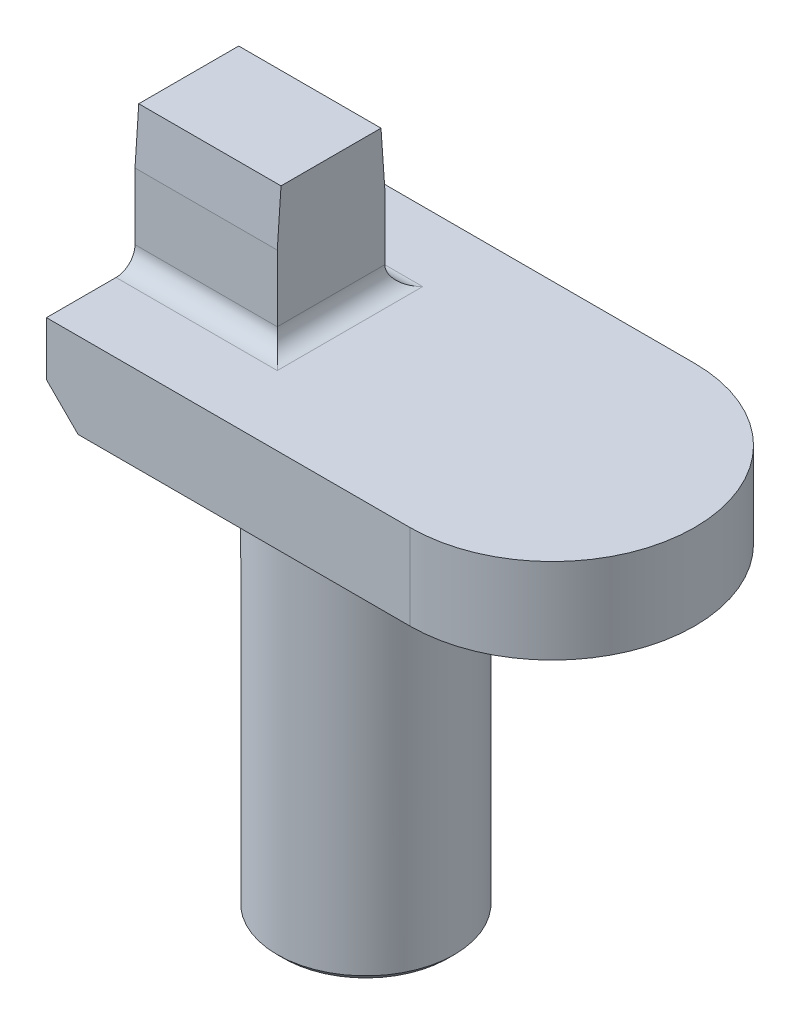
from build123d import *

# Parameters (mm, degrees)
BOSS_EXTRUDE1_DEPTH = 3.429
SKETCH2_R           = 3.556
BOSS_EXTRUDE2_DEPTH = 16.51
CHAMFER2_SIZE       = 0.254
BOSS_EXTRUDE3_START = -3.429
SKETCH3_W           = 5.715
SKETCH3_H           = 4.318
BOSS_EXTRUDE3_DEPTH = 9.017
CHAMFER1_SIZE       = 1.27
FILLET1_R           = 0.762
FILLET2_R           = 0.762
CUT_EXTRUDE1_DEPTH  = 5.715


with BuildPart() as part:
    # Sketch1 → Boss-Extrude1 (new body)
    with BuildSketch(Plane(origin=(0, 0, 0), x_dir=(1, 0, 0), z_dir=(0, 1, 0))):
        with BuildLine():
            Line((7.493, 5.715), (-7.112, 5.715))
            Line((-7.112, 5.715), (-7.112, -5.715))
            Line((-7.112, -5.715), (7.493, -5.715))
            ThreePointArc((7.493, -5.715), (13.208, 0), (7.493, 5.715))
        make_face()
    extrude(amount=BOSS_EXTRUDE1_DEPTH)

    # Sketch2 → Boss-Extrude2 (add)
    with BuildSketch(Plane.XZ):
        with Locations(Location((0, 0, 0), (0, 0, 90))):
            Circle(SKETCH2_R)
    extrude(amount=BOSS_EXTRUDE2_DEPTH)

    # Chamfer2
    chamfer2_edges = [part.edges().sort_by_distance(p)[0] for p in [
        (0, -16.51, -3.556),
    ]]
    chamfer(chamfer2_edges, length=CHAMFER2_SIZE)

    # Sketch3 → Boss-Extrude3 (add)
    with BuildSketch(Plane(origin=(0, 3.429, 0), x_dir=(1, 0, 0), z_dir=(0, 1, 0)).offset(BOSS_EXTRUDE3_START)):
        with Locations((-4.2545, 0)):
            Rectangle(SKETCH3_W, SKETCH3_H)
    extrude(amount=BOSS_EXTRUDE3_DEPTH)

    # Chamfer1
    chamfer1_edges = [part.edges().sort_by_distance(p)[0] for p in [
        (-7.112, 0, 0),
    ]]
    chamfer(chamfer1_edges, length=CHAMFER1_SIZE)

    # Fillet1
    fillet1_edges = [part.edges().sort_by_distance(p)[0] for p in [
        (-1.397, 3.429, 0),
        (-4.2545, 3.429, -2.159),
        (-4.2545, 3.429, 2.159),
    ]]
    fillet(fillet1_edges, radius=FILLET1_R)

    # Fillet2
    fillet2_edges = [part.edges().sort_by_distance(p)[0] for p in [
        (0, 0, -3.556),
    ]]
    fillet(fillet2_edges, radius=FILLET2_R)

    # Sketch4 → Cut-Extrude1 (cut)
    with BuildSketch(Plane.ZY.offset(7.112)):
        Polygon((-2.159, 6.858), (-2.008028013, 9.017), (-2.159, 9.017), align=None)
        Polygon((2.008028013, 9.017), (2.159, 9.017), (2.159, 6.858), align=None)
    extrude(amount=-CUT_EXTRUDE1_DEPTH, mode=Mode.SUBTRACT)


solid = part.part
